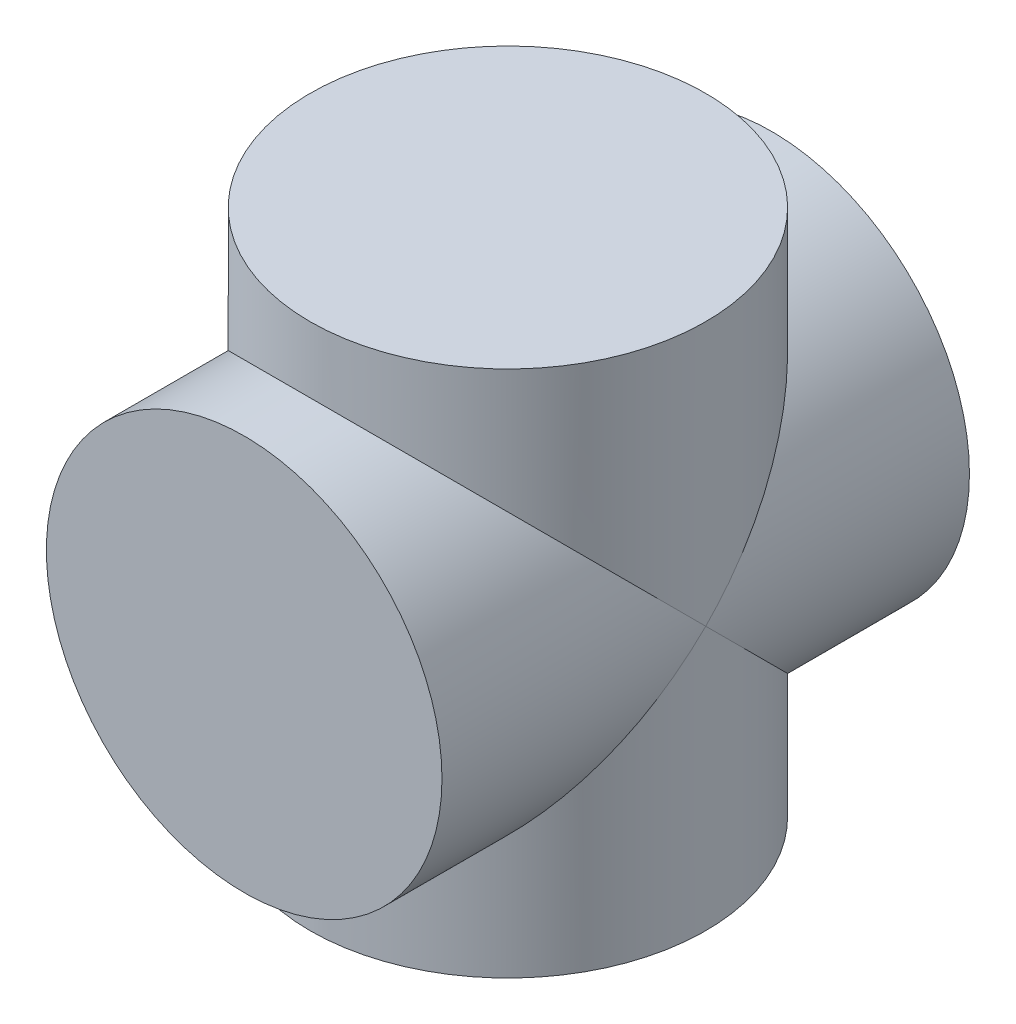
ISO-10303-21;
HEADER;
FILE_DESCRIPTION(('STEP AP214'),'2;1');
FILE_NAME('part.step','',(''),(''),'','','');
FILE_SCHEMA(('AUTOMOTIVE_DESIGN { 1 0 10303 214 1 1 1 1 }'));
ENDSEC;
DATA;
#1=APPLICATION_CONTEXT('core data for automotive mechanical design processes');
#2=APPLICATION_PROTOCOL_DEFINITION('international standard','automotive_design',2000,#1);
#3=PRODUCT_CONTEXT('',#1,'mechanical');
#4=PRODUCT('Part','Part','',(#3));
#5=PRODUCT_RELATED_PRODUCT_CATEGORY('part','',(#4));
#6=PRODUCT_DEFINITION_FORMATION('','',#4);
#7=PRODUCT_DEFINITION_CONTEXT('part definition',#1,'design');
#8=PRODUCT_DEFINITION('design','',#6,#7);
#9=PRODUCT_DEFINITION_SHAPE('','',#8);
#10=(LENGTH_UNIT() NAMED_UNIT(*) SI_UNIT(.MILLI.,.METRE.));
#11=(NAMED_UNIT(*) PLANE_ANGLE_UNIT() SI_UNIT($,.RADIAN.));
#12=(NAMED_UNIT(*) SI_UNIT($,.STERADIAN.) SOLID_ANGLE_UNIT());
#13=UNCERTAINTY_MEASURE_WITH_UNIT(LENGTH_MEASURE(1.E-05),#10,'distance_accuracy_value','');
#14=(GEOMETRIC_REPRESENTATION_CONTEXT(3) GLOBAL_UNCERTAINTY_ASSIGNED_CONTEXT((#13)) GLOBAL_UNIT_ASSIGNED_CONTEXT((#10,
#11,#12)) REPRESENTATION_CONTEXT('',''));
#15=CARTESIAN_POINT('',(0.,0.,0.));
#16=DIRECTION('',(0.,0.,1.));
#17=DIRECTION('',(1.,0.,0.));
#18=AXIS2_PLACEMENT_3D('',#15,#16,#17);
#19=CARTESIAN_POINT('',(0.,0.,40.));
#20=DIRECTION('',(0.,0.,-1.));
#21=DIRECTION('',(-1.,0.,0.));
#22=AXIS2_PLACEMENT_3D('',#19,#20,#21);
#23=CYLINDRICAL_SURFACE('',#22,15.);
#24=CARTESIAN_POINT('',(0.,0.,20.));
#25=DIRECTION('',(0.,-0.707106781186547,-0.707106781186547));
#26=DIRECTION('',(0.,0.707106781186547,-0.707106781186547));
#27=AXIS2_PLACEMENT_3D('',#24,#25,#26);
#28=ELLIPSE('',#27,21.2132034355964,15.);
#29=CARTESIAN_POINT('',(-15.,0.,20.));
#30=VERTEX_POINT('',#29);
#31=CARTESIAN_POINT('',(15.,0.,20.));
#32=VERTEX_POINT('',#31);
#33=EDGE_CURVE('E49',#30,#32,#28,.T.);
#34=ORIENTED_EDGE('',*,*,#33,.T.);
#35=CARTESIAN_POINT('',(0.,0.,20.));
#36=DIRECTION('',(0.,0.707106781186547,-0.707106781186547));
#37=DIRECTION('',(0.,-0.707106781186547,-0.707106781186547));
#38=AXIS2_PLACEMENT_3D('',#35,#36,#37);
#39=ELLIPSE('',#38,21.2132034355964,15.);
#40=EDGE_CURVE('E38',#32,#30,#39,.T.);
#41=ORIENTED_EDGE('',*,*,#40,.T.);
#42=EDGE_LOOP('',(#34,#41));
#43=FACE_BOUND('',#42,.T.);
#44=CARTESIAN_POINT('',(0.,0.,0.));
#45=DIRECTION('',(0.,0.,1.));
#46=DIRECTION('',(1.,0.,0.));
#47=AXIS2_PLACEMENT_3D('',#44,#45,#46);
#48=CIRCLE('',#47,15.);
#49=CARTESIAN_POINT('',(15.,0.,0.));
#50=VERTEX_POINT('',#49);
#51=EDGE_CURVE('E61',#50,#50,#48,.T.);
#52=ORIENTED_EDGE('',*,*,#51,.T.);
#53=EDGE_LOOP('',(#52));
#54=FACE_BOUND('',#53,.T.);
#55=ADVANCED_FACE('F31',(#43,#54),#23,.T.);
#56=CARTESIAN_POINT('',(0.,0.,0.));
#57=DIRECTION('',(0.,0.,1.));
#58=DIRECTION('',(1.,0.,0.));
#59=AXIS2_PLACEMENT_3D('',#56,#57,#58);
#60=PLANE('',#59);
#61=ORIENTED_EDGE('',*,*,#51,.F.);
#62=EDGE_LOOP('',(#61));
#63=FACE_BOUND('',#62,.T.);
#64=ADVANCED_FACE('F87',(#63),#60,.F.);
#65=CARTESIAN_POINT('',(-15.,-20.,20.));
#66=DIRECTION('',(0.,-1.,0.));
#67=DIRECTION('',(0.,0.,-1.));
#68=AXIS2_PLACEMENT_3D('',#65,#66,#67);
#69=PLANE('',#68);
#70=CARTESIAN_POINT('',(0.,-20.,20.));
#71=DIRECTION('',(0.,1.,0.));
#72=DIRECTION('',(0.,0.,1.));
#73=AXIS2_PLACEMENT_3D('',#70,#71,#72);
#74=CIRCLE('',#73,15.);
#75=CARTESIAN_POINT('',(0.,-20.,35.));
#76=VERTEX_POINT('',#75);
#77=EDGE_CURVE('E64',#76,#76,#74,.T.);
#78=ORIENTED_EDGE('',*,*,#77,.F.);
#79=EDGE_LOOP('',(#78));
#80=FACE_BOUND('',#79,.T.);
#81=ADVANCED_FACE('F83',(#80),#69,.T.);
#82=CARTESIAN_POINT('',(0.,29.3604539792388,20.));
#83=DIRECTION('',(0.,1.,0.));
#84=DIRECTION('',(0.,0.,1.));
#85=AXIS2_PLACEMENT_3D('',#82,#83,#84);
#86=CYLINDRICAL_SURFACE('',#85,15.);
#87=ORIENTED_EDGE('',*,*,#77,.T.);
#88=EDGE_LOOP('',(#87));
#89=FACE_BOUND('',#88,.T.);
#90=ORIENTED_EDGE('',*,*,#40,.F.);
#91=CARTESIAN_POINT('',(0.,0.,20.));
#92=DIRECTION('',(0.,-0.707106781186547,-0.707106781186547));
#93=DIRECTION('',(0.,0.707106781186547,-0.707106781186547));
#94=AXIS2_PLACEMENT_3D('',#91,#92,#93);
#95=ELLIPSE('',#94,21.2132034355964,15.);
#96=EDGE_CURVE('E43',#30,#32,#95,.F.);
#97=ORIENTED_EDGE('',*,*,#96,.F.);
#98=EDGE_LOOP('',(#90,#97));
#99=FACE_BOUND('',#98,.T.);
#100=ADVANCED_FACE('F55',(#89,#99),#86,.T.);
#101=CARTESIAN_POINT('',(0.,20.,20.));
#102=DIRECTION('',(0.,1.,0.));
#103=DIRECTION('',(0.,0.,1.));
#104=AXIS2_PLACEMENT_3D('',#101,#102,#103);
#105=CIRCLE('',#104,15.);
#106=CARTESIAN_POINT('',(0.,20.,35.));
#107=VERTEX_POINT('',#106);
#108=EDGE_CURVE('E69',#107,#107,#105,.T.);
#109=ORIENTED_EDGE('',*,*,#108,.F.);
#110=EDGE_LOOP('',(#109));
#111=FACE_BOUND('',#110,.T.);
#112=CARTESIAN_POINT('',(0.,0.,20.));
#113=DIRECTION('',(0.,0.707106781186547,-0.707106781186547));
#114=DIRECTION('',(0.,-0.707106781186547,-0.707106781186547));
#115=AXIS2_PLACEMENT_3D('',#112,#113,#114);
#116=ELLIPSE('',#115,21.2132034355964,15.);
#117=EDGE_CURVE('E11',#32,#30,#116,.F.);
#118=ORIENTED_EDGE('',*,*,#117,.F.);
#119=ORIENTED_EDGE('',*,*,#33,.F.);
#120=EDGE_LOOP('',(#118,#119));
#121=FACE_BOUND('',#120,.T.);
#122=ADVANCED_FACE('F50',(#111,#121),#86,.T.);
#123=CARTESIAN_POINT('',(-15.,20.,20.));
#124=DIRECTION('',(0.,1.,0.));
#125=DIRECTION('',(0.,0.,1.));
#126=AXIS2_PLACEMENT_3D('',#123,#124,#125);
#127=PLANE('',#126);
#128=ORIENTED_EDGE('',*,*,#108,.T.);
#129=EDGE_LOOP('',(#128));
#130=FACE_BOUND('',#129,.T.);
#131=ADVANCED_FACE('F73',(#130),#127,.T.);
#132=CARTESIAN_POINT('',(0.,0.,40.));
#133=DIRECTION('',(0.,0.,1.));
#134=DIRECTION('',(1.,0.,0.));
#135=AXIS2_PLACEMENT_3D('',#132,#133,#134);
#136=PLANE('',#135);
#137=CARTESIAN_POINT('',(0.,0.,40.));
#138=DIRECTION('',(0.,0.,1.));
#139=DIRECTION('',(1.,0.,0.));
#140=AXIS2_PLACEMENT_3D('',#137,#138,#139);
#141=CIRCLE('',#140,15.);
#142=CARTESIAN_POINT('',(15.,0.,40.));
#143=VERTEX_POINT('',#142);
#144=EDGE_CURVE('E56',#143,#143,#141,.T.);
#145=ORIENTED_EDGE('',*,*,#144,.T.);
#146=EDGE_LOOP('',(#145));
#147=FACE_BOUND('',#146,.T.);
#148=ADVANCED_FACE('F81',(#147),#136,.T.);
#149=ORIENTED_EDGE('',*,*,#144,.F.);
#150=EDGE_LOOP('',(#149));
#151=FACE_BOUND('',#150,.T.);
#152=ORIENTED_EDGE('',*,*,#96,.T.);
#153=ORIENTED_EDGE('',*,*,#117,.T.);
#154=EDGE_LOOP('',(#152,#153));
#155=FACE_BOUND('',#154,.T.);
#156=ADVANCED_FACE('F58',(#151,#155),#23,.T.);
#157=CLOSED_SHELL('',(#55,#64,#81,#100,#122,#131,#148,#156));
#158=MANIFOLD_SOLID_BREP('B2',#157);
#159=ADVANCED_BREP_SHAPE_REPRESENTATION('',(#18,#158),#14);
#160=SHAPE_DEFINITION_REPRESENTATION(#9,#159);
ENDSEC;
END-ISO-10303-21;
